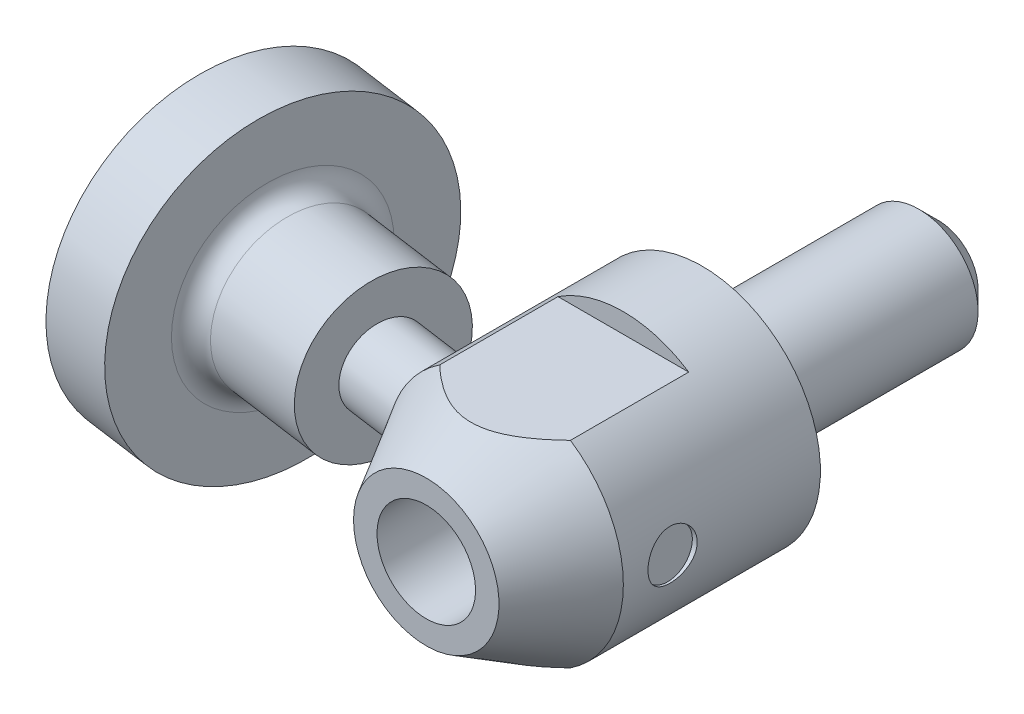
ISO-10303-21;
HEADER;
FILE_DESCRIPTION(('STEP AP214'),'2;1');
FILE_NAME('part.step','',(''),(''),'','','');
FILE_SCHEMA(('AUTOMOTIVE_DESIGN { 1 0 10303 214 1 1 1 1 }'));
ENDSEC;
DATA;
#1=APPLICATION_CONTEXT('core data for automotive mechanical design processes');
#2=APPLICATION_PROTOCOL_DEFINITION('international standard','automotive_design',2000,#1);
#3=PRODUCT_CONTEXT('',#1,'mechanical');
#4=PRODUCT('Part','Part','',(#3));
#5=PRODUCT_RELATED_PRODUCT_CATEGORY('part','',(#4));
#6=PRODUCT_DEFINITION_FORMATION('','',#4);
#7=PRODUCT_DEFINITION_CONTEXT('part definition',#1,'design');
#8=PRODUCT_DEFINITION('design','',#6,#7);
#9=PRODUCT_DEFINITION_SHAPE('','',#8);
#10=(LENGTH_UNIT() NAMED_UNIT(*) SI_UNIT(.MILLI.,.METRE.));
#11=(NAMED_UNIT(*) PLANE_ANGLE_UNIT() SI_UNIT($,.RADIAN.));
#12=(NAMED_UNIT(*) SI_UNIT($,.STERADIAN.) SOLID_ANGLE_UNIT());
#13=UNCERTAINTY_MEASURE_WITH_UNIT(LENGTH_MEASURE(1.E-05),#10,'distance_accuracy_value','');
#14=(GEOMETRIC_REPRESENTATION_CONTEXT(3) GLOBAL_UNCERTAINTY_ASSIGNED_CONTEXT((#13)) GLOBAL_UNIT_ASSIGNED_CONTEXT((#10,
#11,#12)) REPRESENTATION_CONTEXT('',''));
#15=CARTESIAN_POINT('',(0.,0.,0.));
#16=DIRECTION('',(0.,0.,1.));
#17=DIRECTION('',(1.,0.,0.));
#18=AXIS2_PLACEMENT_3D('',#15,#16,#17);
#19=CARTESIAN_POINT('',(-17.3712421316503,0.,5.40187613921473));
#20=DIRECTION('',(0.990268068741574,0.,0.139173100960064));
#21=DIRECTION('',(0.139173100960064,0.,-0.990268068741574));
#22=AXIS2_PLACEMENT_3D('',#19,#20,#21);
#23=CYLINDRICAL_SURFACE('',#22,2.);
#24=CARTESIAN_POINT('',(-9.6966645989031,0.,6.48046767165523));
#25=DIRECTION('',(-0.990268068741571,0.,-0.139173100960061));
#26=DIRECTION('',(-0.139173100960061,0.,0.990268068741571));
#27=AXIS2_PLACEMENT_3D('',#24,#25,#26);
#28=CIRCLE('',#27,2.);
#29=CARTESIAN_POINT('',(-9.97501080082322,0.,8.46100380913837));
#30=VERTEX_POINT('',#29);
#31=EDGE_CURVE('E182',#30,#30,#28,.T.);
#32=ORIENTED_EDGE('',*,*,#31,.F.);
#33=EDGE_LOOP('',(#32));
#34=FACE_BOUND('',#33,.T.);
#35=CARTESIAN_POINT('',(-6.,0.,4.98034485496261));
#36=CARTESIAN_POINT('',(-6.00000039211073,0.105603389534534,4.98034400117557));
#37=CARTESIAN_POINT('',(-5.99718509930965,0.211203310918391,4.98922090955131));
#38=CARTESIAN_POINT('',(-5.98624453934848,0.419204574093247,5.02427801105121));
#39=CARTESIAN_POINT('',(-5.97811814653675,0.52160523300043,5.05046187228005));
#40=CARTESIAN_POINT('',(-5.95746826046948,0.720077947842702,5.11882553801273));
#41=CARTESIAN_POINT('',(-5.94495719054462,0.816166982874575,5.16096017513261));
#42=CARTESIAN_POINT('',(-5.91678982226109,1.00013635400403,5.25959384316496));
#43=CARTESIAN_POINT('',(-5.9011327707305,1.08801471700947,5.3160963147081));
#44=CARTESIAN_POINT('',(-5.86725402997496,1.25827871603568,5.44502853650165));
#45=CARTESIAN_POINT('',(-5.84894035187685,1.34012567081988,5.51814419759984));
#46=CARTESIAN_POINT('',(-5.81222824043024,1.49133103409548,5.67631438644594));
#47=CARTESIAN_POINT('',(-5.79382977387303,1.56068403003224,5.76137406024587));
#48=CARTESIAN_POINT('',(-5.75735804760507,1.6904830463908,5.94856947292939));
#49=CARTESIAN_POINT('',(-5.73942503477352,1.74979423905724,6.05152305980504));
#50=CARTESIAN_POINT('',(-5.70770502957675,1.85065202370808,6.26641398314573));
#51=CARTESIAN_POINT('',(-5.69391813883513,1.89219818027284,6.37835153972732));
#52=CARTESIAN_POINT('',(-5.6724024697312,1.95575656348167,6.60761364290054));
#53=CARTESIAN_POINT('',(-5.66464247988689,1.97786950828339,6.72490705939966));
#54=CARTESIAN_POINT('',(-5.65630412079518,2.00159880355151,6.96178821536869));
#55=CARTESIAN_POINT('',(-5.65572134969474,2.00322771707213,7.0813745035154));
#56=CARTESIAN_POINT('',(-5.66177310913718,1.98604814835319,7.31025202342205));
#57=CARTESIAN_POINT('',(-5.66789403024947,1.96869417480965,7.41966746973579));
#58=CARTESIAN_POINT('',(-5.68588873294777,1.91609886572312,7.63361031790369));
#59=CARTESIAN_POINT('',(-5.69776183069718,1.88085965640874,7.73813829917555));
#60=CARTESIAN_POINT('',(-5.72538347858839,1.79497423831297,7.9358569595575));
#61=CARTESIAN_POINT('',(-5.74098917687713,1.74488256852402,8.02930985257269));
#62=CARTESIAN_POINT('',(-5.77456168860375,1.6303342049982,8.20647564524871));
#63=CARTESIAN_POINT('',(-5.79252883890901,1.56587546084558,8.29018715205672));
#64=CARTESIAN_POINT('',(-5.82949753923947,1.42218525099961,8.44829716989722));
#65=CARTESIAN_POINT('',(-5.84851396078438,1.34257140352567,8.52234460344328));
#66=CARTESIAN_POINT('',(-5.88506531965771,1.1720095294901,8.65643852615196));
#67=CARTESIAN_POINT('',(-5.90260003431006,1.08105980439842,8.71648291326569));
#68=CARTESIAN_POINT('',(-5.934823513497,0.887546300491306,8.82262516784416));
#69=CARTESIAN_POINT('',(-5.94942132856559,0.78473291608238,8.86829669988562));
#70=CARTESIAN_POINT('',(-5.97358226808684,0.572464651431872,8.94221653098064));
#71=CARTESIAN_POINT('',(-5.98314579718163,0.463010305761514,8.97046623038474));
#72=CARTESIAN_POINT('',(-5.99614808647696,0.24163085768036,9.00858547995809));
#73=CARTESIAN_POINT('',(-5.99964248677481,0.129737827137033,9.01862204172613));
#74=CARTESIAN_POINT('',(-6.00030493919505,-0.0942163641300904,9.02053636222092));
#75=CARTESIAN_POINT('',(-5.99747348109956,-0.206277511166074,9.01241552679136));
#76=CARTESIAN_POINT('',(-5.98586815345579,-0.425802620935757,8.9784859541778));
#77=CARTESIAN_POINT('',(-5.97717519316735,-0.533308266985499,8.95291799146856));
#78=CARTESIAN_POINT('',(-5.95482802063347,-0.74234815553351,8.88503046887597));
#79=CARTESIAN_POINT('',(-5.94117336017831,-0.843881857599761,8.84270939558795));
#80=CARTESIAN_POINT('',(-5.9101296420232,-1.03936495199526,8.74180457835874));
#81=CARTESIAN_POINT('',(-5.89270045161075,-1.13321660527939,8.68304391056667));
#82=CARTESIAN_POINT('',(-5.8560355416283,-1.30956921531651,8.55085652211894));
#83=CARTESIAN_POINT('',(-5.83679957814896,-1.3920686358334,8.47742781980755));
#84=CARTESIAN_POINT('',(-5.79835952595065,-1.54443845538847,8.31658948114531));
#85=CARTESIAN_POINT('',(-5.77915893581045,-1.61413540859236,8.22901433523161));
#86=CARTESIAN_POINT('',(-5.74327200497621,-1.73751869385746,8.04277132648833));
#87=CARTESIAN_POINT('',(-5.72658508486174,-1.79120871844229,7.94410602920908));
#88=CARTESIAN_POINT('',(-5.69809288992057,-1.87985839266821,7.74084260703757));
#89=CARTESIAN_POINT('',(-5.68618184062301,-1.91522962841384,7.63643909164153));
#90=CARTESIAN_POINT('',(-5.66809902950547,-1.96810732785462,7.42274234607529));
#91=CARTESIAN_POINT('',(-5.6619258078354,-1.98561833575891,7.31345036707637));
#92=CARTESIAN_POINT('',(-5.65606780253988,-2.0022408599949,7.09689407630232));
#93=CARTESIAN_POINT('',(-5.65617961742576,-2.00192916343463,6.98967851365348));
#94=CARTESIAN_POINT('',(-5.66222889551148,-1.98475225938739,6.77676166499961));
#95=CARTESIAN_POINT('',(-5.66816726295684,-1.96788448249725,6.67106061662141));
#96=CARTESIAN_POINT('',(-5.68529598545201,-1.91784226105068,6.46119378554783));
#97=CARTESIAN_POINT('',(-5.69661631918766,-1.8842632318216,6.35713576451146));
#98=CARTESIAN_POINT('',(-5.72322741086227,-1.80181451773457,6.15580547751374));
#99=CARTESIAN_POINT('',(-5.73851963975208,-1.75293916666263,6.05853574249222));
#100=CARTESIAN_POINT('',(-5.77267388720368,-1.63711101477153,5.86618145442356));
#101=CARTESIAN_POINT('',(-5.79171362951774,-1.56911021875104,5.77175817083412));
#102=CARTESIAN_POINT('',(-5.83042885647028,-1.41849819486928,5.59547141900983));
#103=CARTESIAN_POINT('',(-5.85010457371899,-1.3358815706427,5.5136126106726));
#104=CARTESIAN_POINT('',(-5.88846059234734,-1.15532161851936,5.36285076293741));
#105=CARTESIAN_POINT('',(-5.90709923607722,-1.05702239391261,5.29436089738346));
#106=CARTESIAN_POINT('',(-5.94052421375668,-0.849235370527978,5.17593682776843));
#107=CARTESIAN_POINT('',(-5.95531359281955,-0.739756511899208,5.12598794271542));
#108=CARTESIAN_POINT('',(-5.97773608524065,-0.526142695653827,5.05170217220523));
#109=CARTESIAN_POINT('',(-5.9860032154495,-0.422876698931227,5.0250555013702));
#110=CARTESIAN_POINT('',(-5.99713367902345,-0.213071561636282,4.98938149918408));
#111=CARTESIAN_POINT('',(-5.99999960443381,-0.106534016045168,4.98034571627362));
#112=CARTESIAN_POINT('',(-6.,0.,4.98034485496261));
#113=B_SPLINE_CURVE_WITH_KNOTS('',3,(#35,#36,#37,#38,#39,#40,#41,#42,#43,#44,#45,#46,#47,#48,
#49,#50,#51,#52,#53,#54,#55,#56,#57,#58,#59,#60,#61,#62,#63,#64,#65,#66,#67,#68,#69,#70,#71,#72,
#73,#74,#75,#76,#77,#78,#79,#80,#81,#82,#83,#84,#85,#86,#87,#88,#89,#90,#91,#92,#93,#94,#95,#96,
#97,#98,#99,#100,#101,#102,#103,#104,#105,#106,#107,#108,#109,#110,#111,#112),.UNSPECIFIED.,.T.,
.F.,(4,2,2,2,2,2,2,2,2,2,2,2,2,2,2,2,2,2,2,2,2,2,2,2,2,2,2,2,2,2,2,2,2,2,2,2,2,2,4),(0.,
0.31640530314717,0.632877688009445,0.948460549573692,1.26411905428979,1.5965227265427,
1.92907005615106,2.28786090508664,2.64666054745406,3.0035894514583,3.36029943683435,
3.69147707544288,4.02261535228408,4.34268179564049,4.66279394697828,4.9924277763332,
5.32211105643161,5.66081085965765,5.99948343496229,6.33503443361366,6.67055945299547,
7.00154537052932,7.33256119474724,7.66728635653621,8.00205677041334,8.34107310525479,
8.68001117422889,9.01096176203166,9.34182812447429,9.66199308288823,9.98220773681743,
10.3105823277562,10.6390787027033,10.9912205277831,11.3434926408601,11.7053508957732,
12.0669220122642,12.3862689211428,12.7054625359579),.UNSPECIFIED.);
#114=CARTESIAN_POINT('',(-6.,0.,4.98034485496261));
#115=VERTEX_POINT('',#114);
#116=EDGE_CURVE('E10',#115,#115,#113,.T.);
#117=ORIENTED_EDGE('',*,*,#116,.F.);
#118=EDGE_LOOP('',(#117));
#119=FACE_BOUND('',#118,.T.);
#120=ADVANCED_FACE('F16',(#34,#119),#23,.T.);
#121=CARTESIAN_POINT('',(-10.0368338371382,0.,8.90089756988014));
#122=DIRECTION('',(-0.990268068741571,0.,-0.139173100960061));
#123=DIRECTION('',(-0.139173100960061,0.,0.990268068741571));
#124=AXIS2_PLACEMENT_3D('',#121,#122,#123);
#125=PLANE('',#124);
#126=ORIENTED_EDGE('',*,*,#31,.T.);
#127=EDGE_LOOP('',(#126));
#128=FACE_BOUND('',#127,.T.);
#129=CARTESIAN_POINT('',(-9.69666459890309,0.,6.48046767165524));
#130=DIRECTION('',(0.990268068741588,0.,0.139173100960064));
#131=DIRECTION('',(0.,-1.,0.));
#132=AXIS2_PLACEMENT_3D('',#129,#130,#131);
#133=CIRCLE('',#132,4.);
#134=CARTESIAN_POINT('',(-9.69666459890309,-4.,6.48046767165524));
#135=VERTEX_POINT('',#134);
#136=EDGE_CURVE('E293',#135,#135,#133,.T.);
#137=ORIENTED_EDGE('',*,*,#136,.T.);
#138=EDGE_LOOP('',(#137));
#139=FACE_BOUND('',#138,.T.);
#140=ADVANCED_FACE('F171',(#128,#139),#125,.F.);
#141=CARTESIAN_POINT('',(-4.09486246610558,0.,7.26774961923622));
#142=DIRECTION('',(-0.990268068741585,0.,-0.139173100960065));
#143=DIRECTION('',(0.,1.,0.));
#144=AXIS2_PLACEMENT_3D('',#141,#142,#143);
#145=CYLINDRICAL_SURFACE('',#144,1.65);
#146=CARTESIAN_POINT('',(-19.104211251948,0.,5.15832321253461));
#147=DIRECTION('',(-0.990268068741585,0.,-0.139173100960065));
#148=DIRECTION('',(0.,1.,0.));
#149=AXIS2_PLACEMENT_3D('',#146,#147,#148);
#150=CIRCLE('',#149,1.65);
#151=CARTESIAN_POINT('',(-19.104211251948,1.64999999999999,5.15832321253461));
#152=VERTEX_POINT('',#151);
#153=EDGE_CURVE('E99',#152,#152,#150,.T.);
#154=ORIENTED_EDGE('',*,*,#153,.T.);
#155=EDGE_LOOP('',(#154));
#156=FACE_BOUND('',#155,.T.);
#157=CARTESIAN_POINT('',(-17.6188091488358,0.,5.36708286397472));
#158=DIRECTION('',(0.990268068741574,0.,0.139173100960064));
#159=DIRECTION('',(0.139173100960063,0.,-0.990268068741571));
#160=AXIS2_PLACEMENT_3D('',#157,#158,#159);
#161=CIRCLE('',#160,1.65);
#162=CARTESIAN_POINT('',(-17.3891735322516,0.,3.73314055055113));
#163=VERTEX_POINT('',#162);
#164=EDGE_CURVE('E29',#163,#163,#161,.T.);
#165=ORIENTED_EDGE('',*,*,#164,.T.);
#166=EDGE_LOOP('',(#165));
#167=FACE_BOUND('',#166,.T.);
#168=ADVANCED_FACE('F176',(#156,#167),#145,.F.);
#169=CARTESIAN_POINT('',(-19.104211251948,2.,5.15832321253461));
#170=DIRECTION('',(0.990268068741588,0.,0.139173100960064));
#171=DIRECTION('',(0.,-1.,0.));
#172=AXIS2_PLACEMENT_3D('',#169,#170,#171);
#173=PLANE('',#172);
#174=CARTESIAN_POINT('',(-19.1042112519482,0.,5.15832321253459));
#175=DIRECTION('',(0.990268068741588,0.,0.139173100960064));
#176=DIRECTION('',(0.,-1.,0.));
#177=AXIS2_PLACEMENT_3D('',#174,#175,#176);
#178=CIRCLE('',#177,8.);
#179=CARTESIAN_POINT('',(-19.1042112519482,-8.00000000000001,5.15832321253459));
#180=VERTEX_POINT('',#179);
#181=EDGE_CURVE('E278',#180,#180,#178,.T.);
#182=ORIENTED_EDGE('',*,*,#181,.F.);
#183=EDGE_LOOP('',(#182));
#184=FACE_BOUND('',#183,.T.);
#185=ORIENTED_EDGE('',*,*,#153,.F.);
#186=EDGE_LOOP('',(#185));
#187=FACE_BOUND('',#186,.T.);
#188=ADVANCED_FACE('F247',(#184,#187),#173,.F.);
#189=CARTESIAN_POINT('',(10.9744974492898,0.,9.38561004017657));
#190=DIRECTION('',(0.990268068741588,0.,0.139173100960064));
#191=DIRECTION('',(0.,-1.,0.));
#192=AXIS2_PLACEMENT_3D('',#189,#190,#191);
#193=CYLINDRICAL_SURFACE('',#192,8.);
#194=CARTESIAN_POINT('',(-15.6382730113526,0.,5.64542906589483));
#195=DIRECTION('',(0.990268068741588,0.,0.139173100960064));
#196=DIRECTION('',(0.,-1.,0.));
#197=AXIS2_PLACEMENT_3D('',#194,#195,#196);
#198=CIRCLE('',#197,8.);
#199=CARTESIAN_POINT('',(-15.6382730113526,-8.00000000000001,5.64542906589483));
#200=VERTEX_POINT('',#199);
#201=EDGE_CURVE('E283',#200,#200,#198,.T.);
#202=ORIENTED_EDGE('',*,*,#201,.F.);
#203=EDGE_LOOP('',(#202));
#204=FACE_BOUND('',#203,.T.);
#205=ORIENTED_EDGE('',*,*,#181,.T.);
#206=EDGE_LOOP('',(#205));
#207=FACE_BOUND('',#206,.T.);
#208=ADVANCED_FACE('F260',(#204,#207),#193,.T.);
#209=CARTESIAN_POINT('',(-15.6382730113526,4.99999999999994,5.64542906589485));
#210=DIRECTION('',(-0.990268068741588,0.,-0.139173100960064));
#211=DIRECTION('',(0.,1.,0.));
#212=AXIS2_PLACEMENT_3D('',#209,#210,#211);
#213=PLANE('',#212);
#214=CARTESIAN_POINT('',(-15.6382730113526,0.,5.64542906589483));
#215=DIRECTION('',(0.990268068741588,0.,0.139173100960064));
#216=DIRECTION('',(0.,-1.,0.));
#217=AXIS2_PLACEMENT_3D('',#214,#215,#216);
#218=CIRCLE('',#217,5.);
#219=CARTESIAN_POINT('',(-15.6382730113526,-5.00000000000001,5.64542906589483));
#220=VERTEX_POINT('',#219);
#221=EDGE_CURVE('E287',#220,#220,#218,.T.);
#222=ORIENTED_EDGE('',*,*,#221,.F.);
#223=EDGE_LOOP('',(#222));
#224=FACE_BOUND('',#223,.T.);
#225=ORIENTED_EDGE('',*,*,#201,.T.);
#226=EDGE_LOOP('',(#225));
#227=FACE_BOUND('',#226,.T.);
#228=ADVANCED_FACE('F256',(#224,#227),#213,.F.);
#229=CARTESIAN_POINT('',(-14.648004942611,0.,5.78460216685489));
#230=DIRECTION('',(0.990268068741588,0.,0.139173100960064));
#231=DIRECTION('',(0.,-1.,0.));
#232=AXIS2_PLACEMENT_3D('',#229,#230,#231);
#233=TOROIDAL_SURFACE('',#232,5.,1.);
#234=CARTESIAN_POINT('',(-14.648004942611,0.,5.78460216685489));
#235=DIRECTION('',(0.990268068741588,0.,0.139173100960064));
#236=DIRECTION('',(0.,-1.,0.));
#237=AXIS2_PLACEMENT_3D('',#234,#235,#236);
#238=CIRCLE('',#237,4.);
#239=CARTESIAN_POINT('',(-14.648004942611,-4.,5.78460216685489));
#240=VERTEX_POINT('',#239);
#241=EDGE_CURVE('E291',#240,#240,#238,.T.);
#242=ORIENTED_EDGE('',*,*,#241,.F.);
#243=EDGE_LOOP('',(#242));
#244=FACE_BOUND('',#243,.T.);
#245=ORIENTED_EDGE('',*,*,#221,.T.);
#246=EDGE_LOOP('',(#245));
#247=FACE_BOUND('',#246,.T.);
#248=ADVANCED_FACE('F252',(#244,#247),#233,.F.);
#249=CARTESIAN_POINT('',(10.9744974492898,0.,9.38561004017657));
#250=DIRECTION('',(0.990268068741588,0.,0.139173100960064));
#251=DIRECTION('',(0.,-1.,0.));
#252=AXIS2_PLACEMENT_3D('',#249,#250,#251);
#253=CYLINDRICAL_SURFACE('',#252,4.);
#254=ORIENTED_EDGE('',*,*,#136,.F.);
#255=EDGE_LOOP('',(#254));
#256=FACE_BOUND('',#255,.T.);
#257=ORIENTED_EDGE('',*,*,#241,.T.);
#258=EDGE_LOOP('',(#257));
#259=FACE_BOUND('',#258,.T.);
#260=ADVANCED_FACE('F249',(#256,#259),#253,.T.);
#261=CARTESIAN_POINT('',(-17.6188091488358,0.,5.36708286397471));
#262=DIRECTION('',(0.990268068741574,0.,0.139173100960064));
#263=DIRECTION('',(0.139173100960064,0.,-0.990268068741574));
#264=AXIS2_PLACEMENT_3D('',#261,#262,#263);
#265=PLANE('',#264);
#266=ORIENTED_EDGE('',*,*,#164,.F.);
#267=EDGE_LOOP('',(#266));
#268=FACE_BOUND('',#267,.T.);
#269=ADVANCED_FACE('F191',(#268),#265,.F.);
#270=CARTESIAN_POINT('',(0.,0.,-38.3689686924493));
#271=DIRECTION('',(0.,0.,-1.));
#272=DIRECTION('',(-1.,0.,0.));
#273=AXIS2_PLACEMENT_3D('',#270,#271,#272);
#274=CYLINDRICAL_SURFACE('',#273,2.5);
#275=CARTESIAN_POINT('',(0.,0.,1.5));
#276=DIRECTION('',(0.,0.,-1.));
#277=DIRECTION('',(-1.,0.,0.));
#278=AXIS2_PLACEMENT_3D('',#275,#276,#277);
#279=CIRCLE('',#278,2.5);
#280=CARTESIAN_POINT('',(-2.5,0.,1.5));
#281=VERTEX_POINT('',#280);
#282=EDGE_CURVE('E214',#281,#281,#279,.T.);
#283=ORIENTED_EDGE('',*,*,#282,.T.);
#284=EDGE_LOOP('',(#283));
#285=FACE_BOUND('',#284,.T.);
#286=CARTESIAN_POINT('',(0.,0.,14.));
#287=DIRECTION('',(0.,0.,-1.));
#288=DIRECTION('',(-1.,0.,0.));
#289=AXIS2_PLACEMENT_3D('',#286,#287,#288);
#290=CIRCLE('',#289,2.5);
#291=CARTESIAN_POINT('',(-2.5,0.,14.));
#292=VERTEX_POINT('',#291);
#293=EDGE_CURVE('E210',#292,#292,#290,.T.);
#294=ORIENTED_EDGE('',*,*,#293,.F.);
#295=EDGE_LOOP('',(#294));
#296=FACE_BOUND('',#295,.T.);
#297=ADVANCED_FACE('F186',(#285,#296),#274,.F.);
#298=CARTESIAN_POINT('',(0.,0.,-38.3689686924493));
#299=DIRECTION('',(0.,0.,-1.));
#300=DIRECTION('',(-1.,0.,0.));
#301=AXIS2_PLACEMENT_3D('',#298,#299,#300);
#302=CYLINDRICAL_SURFACE('',#301,6.);
#303=CARTESIAN_POINT('',(0.,0.,0.));
#304=DIRECTION('',(0.,0.,-1.));
#305=DIRECTION('',(-1.,0.,0.));
#306=AXIS2_PLACEMENT_3D('',#303,#304,#305);
#307=CIRCLE('',#306,6.);
#308=CARTESIAN_POINT('',(-6.,0.,0.));
#309=VERTEX_POINT('',#308);
#310=EDGE_CURVE('E195',#309,#309,#307,.T.);
#311=ORIENTED_EDGE('',*,*,#310,.F.);
#312=EDGE_LOOP('',(#311));
#313=FACE_BOUND('',#312,.T.);
#314=CARTESIAN_POINT('',(0.,0.,10.));
#315=DIRECTION('',(0.,0.,-1.));
#316=DIRECTION('',(-1.,0.,0.));
#317=AXIS2_PLACEMENT_3D('',#314,#315,#316);
#318=CIRCLE('',#317,6.);
#319=CARTESIAN_POINT('',(3.31662479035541,5.,10.));
#320=VERTEX_POINT('',#319);
#321=CARTESIAN_POINT('',(3.31662479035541,-5.,10.));
#322=VERTEX_POINT('',#321);
#323=EDGE_CURVE('E82',#320,#322,#318,.T.);
#324=ORIENTED_EDGE('',*,*,#323,.T.);
#325=DIRECTION('',(0.,0.,-1.));
#326=VECTOR('',#325,1.);
#327=CARTESIAN_POINT('',(3.31662479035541,-5.,-38.3689686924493));
#328=LINE('',#327,#326);
#329=CARTESIAN_POINT('',(3.31662479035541,-5.,4.));
#330=VERTEX_POINT('',#329);
#331=EDGE_CURVE('E71',#322,#330,#328,.T.);
#332=ORIENTED_EDGE('',*,*,#331,.T.);
#333=CARTESIAN_POINT('',(0.,0.,4.));
#334=DIRECTION('',(0.,0.,1.));
#335=DIRECTION('',(1.,0.,0.));
#336=AXIS2_PLACEMENT_3D('',#333,#334,#335);
#337=CIRCLE('',#336,6.);
#338=CARTESIAN_POINT('',(-3.31662479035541,-5.,4.));
#339=VERTEX_POINT('',#338);
#340=EDGE_CURVE('E60',#339,#330,#337,.T.);
#341=ORIENTED_EDGE('',*,*,#340,.F.);
#342=DIRECTION('',(0.,0.,-1.));
#343=VECTOR('',#342,1.);
#344=CARTESIAN_POINT('',(-3.31662479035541,-5.,-38.3689686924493));
#345=LINE('',#344,#343);
#346=CARTESIAN_POINT('',(-3.31662479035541,-5.,10.));
#347=VERTEX_POINT('',#346);
#348=EDGE_CURVE('E66',#339,#347,#345,.F.);
#349=ORIENTED_EDGE('',*,*,#348,.T.);
#350=CARTESIAN_POINT('',(-3.31662479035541,5.,10.));
#351=VERTEX_POINT('',#350);
#352=EDGE_CURVE('E197',#347,#351,#318,.T.);
#353=ORIENTED_EDGE('',*,*,#352,.T.);
#354=DIRECTION('',(0.,0.,-1.));
#355=VECTOR('',#354,1.);
#356=CARTESIAN_POINT('',(-3.31662479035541,5.,-38.3689686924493));
#357=LINE('',#356,#355);
#358=CARTESIAN_POINT('',(-3.31662479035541,5.,4.));
#359=VERTEX_POINT('',#358);
#360=EDGE_CURVE('E67',#351,#359,#357,.T.);
#361=ORIENTED_EDGE('',*,*,#360,.T.);
#362=CARTESIAN_POINT('',(0.,0.,4.));
#363=DIRECTION('',(0.,0.,1.));
#364=DIRECTION('',(1.,0.,0.));
#365=AXIS2_PLACEMENT_3D('',#362,#363,#364);
#366=CIRCLE('',#365,6.);
#367=CARTESIAN_POINT('',(3.31662479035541,5.,4.));
#368=VERTEX_POINT('',#367);
#369=EDGE_CURVE('E218',#368,#359,#366,.T.);
#370=ORIENTED_EDGE('',*,*,#369,.F.);
#371=DIRECTION('',(0.,0.,-1.));
#372=VECTOR('',#371,1.);
#373=CARTESIAN_POINT('',(3.31662479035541,5.,-38.3689686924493));
#374=LINE('',#373,#372);
#375=EDGE_CURVE('E221',#368,#320,#374,.F.);
#376=ORIENTED_EDGE('',*,*,#375,.T.);
#377=EDGE_LOOP('',(#324,#332,#341,#349,#353,#361,#370,#376));
#378=FACE_BOUND('',#377,.T.);
#379=CARTESIAN_POINT('',(6.,0.,8.75));
#380=CARTESIAN_POINT('',(5.99999871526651,0.0694090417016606,8.74999752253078));
#381=CARTESIAN_POINT('',(5.99878328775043,0.138848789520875,8.74419933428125));
#382=CARTESIAN_POINT('',(5.9940520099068,0.275761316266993,8.72118065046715));
#383=CARTESIAN_POINT('',(5.99053441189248,0.343232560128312,8.70395147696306));
#384=CARTESIAN_POINT('',(5.98159109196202,0.474209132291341,8.65862954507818));
#385=CARTESIAN_POINT('',(5.97616727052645,0.537718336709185,8.63054760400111));
#386=CARTESIAN_POINT('',(5.96399927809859,0.659120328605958,8.56435039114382));
#387=CARTESIAN_POINT('',(5.95725516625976,0.717013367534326,8.52623556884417));
#388=CARTESIAN_POINT('',(5.94307700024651,0.826390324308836,8.44046365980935));
#389=CARTESIAN_POINT('',(5.93563505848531,0.877780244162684,8.39268799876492));
#390=CARTESIAN_POINT('',(5.92095657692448,0.971877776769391,8.28920534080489));
#391=CARTESIAN_POINT('',(5.91372005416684,1.01458467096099,8.23349768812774));
#392=CARTESIAN_POINT('',(5.90019442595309,1.09051031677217,8.11504803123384));
#393=CARTESIAN_POINT('',(5.89391545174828,1.12363054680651,8.05224161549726));
#394=CARTESIAN_POINT('',(5.8831284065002,1.17881119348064,7.92180254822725));
#395=CARTESIAN_POINT('',(5.87862014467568,1.20087280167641,7.85417041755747));
#396=CARTESIAN_POINT('',(5.87196500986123,1.23300240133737,7.71701476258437));
#397=CARTESIAN_POINT('',(5.86978556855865,1.24323597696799,7.64753164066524));
#398=CARTESIAN_POINT('',(5.86793690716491,1.25193357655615,7.50780315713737));
#399=CARTESIAN_POINT('',(5.86826740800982,1.25039890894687,7.43755788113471));
#400=CARTESIAN_POINT('',(5.87137174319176,1.23573719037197,7.29951897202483));
#401=CARTESIAN_POINT('',(5.87410533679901,1.2228010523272,7.23170402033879));
#402=CARTESIAN_POINT('',(5.88164437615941,1.18600543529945,7.09922849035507));
#403=CARTESIAN_POINT('',(5.88644992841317,1.16214539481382,7.03456807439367));
#404=CARTESIAN_POINT('',(5.89763191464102,1.10400003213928,6.90969277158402));
#405=CARTESIAN_POINT('',(5.90401953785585,1.06964002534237,6.84951370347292));
#406=CARTESIAN_POINT('',(5.91763890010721,0.991522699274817,6.73570425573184));
#407=CARTESIAN_POINT('',(5.92487074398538,0.947764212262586,6.68207469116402));
#408=CARTESIAN_POINT('',(5.9395373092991,0.851074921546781,6.58178603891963));
#409=CARTESIAN_POINT('',(5.94697323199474,0.797981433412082,6.53528383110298));
#410=CARTESIAN_POINT('',(5.96108088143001,0.684667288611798,6.45181955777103));
#411=CARTESIAN_POINT('',(5.96775259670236,0.624446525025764,6.41485763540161));
#412=CARTESIAN_POINT('',(5.97959870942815,0.498405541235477,6.35148991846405));
#413=CARTESIAN_POINT('',(5.98477039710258,0.432575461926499,6.32510319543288));
#414=CARTESIAN_POINT('',(5.99301338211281,0.297284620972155,6.2838082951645));
#415=CARTESIAN_POINT('',(5.99608495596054,0.227824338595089,6.2688986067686));
#416=CARTESIAN_POINT('',(5.99974275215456,0.0885918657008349,6.25120574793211));
#417=CARTESIAN_POINT('',(6.00037293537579,0.0188480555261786,6.24820805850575));
#418=CARTESIAN_POINT('',(5.99919952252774,-0.120143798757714,6.2538449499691));
#419=CARTESIAN_POINT('',(5.99739607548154,-0.189391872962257,6.2624788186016));
#420=CARTESIAN_POINT('',(5.99158564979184,-0.324726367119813,6.29095565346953));
#421=CARTESIAN_POINT('',(5.98760052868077,-0.390837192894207,6.31068748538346));
#422=CARTESIAN_POINT('',(5.97787227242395,-0.518811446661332,6.36067786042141));
#423=CARTESIAN_POINT('',(5.97212899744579,-0.580674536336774,6.39093724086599));
#424=CARTESIAN_POINT('',(5.95941241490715,-0.699294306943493,6.46158037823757));
#425=CARTESIAN_POINT('',(5.9524239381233,-0.755973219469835,6.50209192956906));
#426=CARTESIAN_POINT('',(5.93802568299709,-0.861805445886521,6.59191956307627));
#427=CARTESIAN_POINT('',(5.93061585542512,-0.910957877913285,6.64123667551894));
#428=CARTESIAN_POINT('',(5.91606024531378,-1.0011786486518,6.7482555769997));
#429=CARTESIAN_POINT('',(5.90892089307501,-1.04209914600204,6.80608303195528));
#430=CARTESIAN_POINT('',(5.89585601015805,-1.11364719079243,6.92791628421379));
#431=CARTESIAN_POINT('',(5.88993042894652,-1.14427516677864,6.99192182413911));
#432=CARTESIAN_POINT('',(5.88001700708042,-1.19417246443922,7.12396119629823));
#433=CARTESIAN_POINT('',(5.87601872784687,-1.21350309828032,7.19197103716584));
#434=CARTESIAN_POINT('',(5.87039184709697,-1.24044038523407,7.33036655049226));
#435=CARTESIAN_POINT('',(5.86876290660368,-1.24804871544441,7.40075188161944));
#436=CARTESIAN_POINT('',(5.86807907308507,-1.25125926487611,7.54041340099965));
#437=CARTESIAN_POINT('',(5.86897402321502,-1.24709542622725,7.60968407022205));
#438=CARTESIAN_POINT('',(5.87312447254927,-1.22739905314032,7.74651400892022));
#439=CARTESIAN_POINT('',(5.87637994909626,-1.21186662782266,7.8140732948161));
#440=CARTESIAN_POINT('',(5.88486132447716,-1.16998217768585,7.94539777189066));
#441=CARTESIAN_POINT('',(5.8900815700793,-1.14366117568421,8.00917324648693));
#442=CARTESIAN_POINT('',(5.90190705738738,-1.08097457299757,8.13143877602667));
#443=CARTESIAN_POINT('',(5.90851242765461,-1.0446080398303,8.18992833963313));
#444=CARTESIAN_POINT('',(5.92251579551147,-0.962073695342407,8.30112162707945));
#445=CARTESIAN_POINT('',(5.92992613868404,-0.915737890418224,8.35369912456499));
#446=CARTESIAN_POINT('',(5.94461839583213,-0.814924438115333,8.45040949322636));
#447=CARTESIAN_POINT('',(5.9519002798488,-0.760444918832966,8.49454041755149));
#448=CARTESIAN_POINT('',(5.96561444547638,-0.644134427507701,8.57358857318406));
#449=CARTESIAN_POINT('',(5.97203596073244,-0.582225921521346,8.60839367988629));
#450=CARTESIAN_POINT('',(5.98319908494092,-0.453319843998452,8.66705022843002));
#451=CARTESIAN_POINT('',(5.98794216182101,-0.386326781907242,8.69091124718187));
#452=CARTESIAN_POINT('',(5.99432499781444,-0.266015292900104,8.72254027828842));
#453=CARTESIAN_POINT('',(5.99644035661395,-0.213367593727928,8.73281876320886));
#454=CARTESIAN_POINT('',(5.99927832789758,-0.107152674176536,8.74654945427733));
#455=CARTESIAN_POINT('',(6.00000099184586,-0.0535854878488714,8.75000191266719));
#456=CARTESIAN_POINT('',(6.,0.,8.75));
#457=B_SPLINE_CURVE_WITH_KNOTS('',3,(#379,#380,#381,#382,#383,#384,#385,#386,#387,#388,#389,
#390,#391,#392,#393,#394,#395,#396,#397,#398,#399,#400,#401,#402,#403,#404,#405,#406,#407,#408,
#409,#410,#411,#412,#413,#414,#415,#416,#417,#418,#419,#420,#421,#422,#423,#424,#425,#426,#427,
#428,#429,#430,#431,#432,#433,#434,#435,#436,#437,#438,#439,#440,#441,#442,#443,#444,#445,#446,
#447,#448,#449,#450,#451,#452,#453,#454,#455,#456),.UNSPECIFIED.,.T.,.F.,(4,2,2,2,2,2,2,2,2,2,2,
2,2,2,2,2,2,2,2,2,2,2,2,2,2,2,2,2,2,2,2,2,2,2,2,2,2,2,4),(0.,0.208031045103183,
0.416220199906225,0.624202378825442,0.832175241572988,1.04287526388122,1.25359271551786,
1.46640449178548,1.6791933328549,1.88896575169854,2.09871484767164,2.30501712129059,
2.5113300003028,2.71914592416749,2.92698768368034,3.13889526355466,3.35080602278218,
3.56309724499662,3.77536051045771,3.98378339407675,4.19219351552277,4.39855286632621,
4.60492863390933,4.81401583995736,5.02312752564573,5.23571263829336,5.44828889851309,
5.65970050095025,5.87108185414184,6.07829223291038,6.28550062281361,6.49211731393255,
6.6987531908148,6.90919024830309,7.11967575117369,7.33258864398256,7.54531486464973,
7.7059258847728,7.86653096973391),.UNSPECIFIED.);
#458=CARTESIAN_POINT('',(6.,0.,8.75));
#459=VERTEX_POINT('',#458);
#460=EDGE_CURVE('E84',#459,#459,#457,.T.);
#461=ORIENTED_EDGE('',*,*,#460,.T.);
#462=EDGE_LOOP('',(#461));
#463=FACE_BOUND('',#462,.T.);
#464=ORIENTED_EDGE('',*,*,#116,.T.);
#465=EDGE_LOOP('',(#464));
#466=FACE_BOUND('',#465,.T.);
#467=ADVANCED_FACE('F78',(#313,#378,#463,#466),#302,.T.);
#468=CARTESIAN_POINT('',(-12.6621649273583,0.,7.5));
#469=DIRECTION('',(-1.,0.,0.));
#470=DIRECTION('',(0.,0.,1.));
#471=AXIS2_PLACEMENT_3D('',#468,#469,#470);
#472=CYLINDRICAL_SURFACE('',#471,1.25);
#473=ORIENTED_EDGE('',*,*,#460,.F.);
#474=EDGE_LOOP('',(#473));
#475=FACE_BOUND('',#474,.T.);
#476=CARTESIAN_POINT('',(5.75,0.,7.5));
#477=DIRECTION('',(-1.,0.,0.));
#478=DIRECTION('',(0.,0.,1.));
#479=AXIS2_PLACEMENT_3D('',#476,#477,#478);
#480=CIRCLE('',#479,1.25);
#481=CARTESIAN_POINT('',(5.75,0.,8.75));
#482=VERTEX_POINT('',#481);
#483=EDGE_CURVE('E90',#482,#482,#480,.F.);
#484=ORIENTED_EDGE('',*,*,#483,.F.);
#485=EDGE_LOOP('',(#484));
#486=FACE_BOUND('',#485,.T.);
#487=ADVANCED_FACE('F104',(#475,#486),#472,.F.);
#488=CARTESIAN_POINT('',(0.9,0.,1.5));
#489=DIRECTION('',(0.,0.,-1.));
#490=DIRECTION('',(-1.,0.,0.));
#491=AXIS2_PLACEMENT_3D('',#488,#489,#490);
#492=PLANE('',#491);
#493=ORIENTED_EDGE('',*,*,#282,.F.);
#494=EDGE_LOOP('',(#493));
#495=FACE_BOUND('',#494,.T.);
#496=ADVANCED_FACE('F109',(#495),#492,.F.);
#497=CARTESIAN_POINT('',(2.5,0.,14.));
#498=DIRECTION('',(0.,0.,-1.));
#499=DIRECTION('',(-1.,0.,0.));
#500=AXIS2_PLACEMENT_3D('',#497,#498,#499);
#501=PLANE('',#500);
#502=CARTESIAN_POINT('',(0.,0.,14.));
#503=DIRECTION('',(0.,0.,-1.));
#504=DIRECTION('',(-1.,0.,0.));
#505=AXIS2_PLACEMENT_3D('',#502,#503,#504);
#506=CIRCLE('',#505,3.6905989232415);
#507=CARTESIAN_POINT('',(-3.6905989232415,0.,14.));
#508=VERTEX_POINT('',#507);
#509=EDGE_CURVE('E206',#508,#508,#506,.T.);
#510=ORIENTED_EDGE('',*,*,#509,.F.);
#511=EDGE_LOOP('',(#510));
#512=FACE_BOUND('',#511,.T.);
#513=ORIENTED_EDGE('',*,*,#293,.T.);
#514=EDGE_LOOP('',(#513));
#515=FACE_BOUND('',#514,.T.);
#516=ADVANCED_FACE('F134',(#512,#515),#501,.F.);
#517=CARTESIAN_POINT('',(0.,0.,14.));
#518=DIRECTION('',(0.,0.,-1.));
#519=DIRECTION('',(-1.,0.,0.));
#520=AXIS2_PLACEMENT_3D('',#517,#518,#519);
#521=CONICAL_SURFACE('',#520,3.6905989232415,0.523598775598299);
#522=ORIENTED_EDGE('',*,*,#352,.F.);
#523=CARTESIAN_POINT('',(-8.29945801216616,-5.,3.61008181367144));
#524=CARTESIAN_POINT('',(-8.1200267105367,-5.,3.87624090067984));
#525=CARTESIAN_POINT('',(-7.93956994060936,-5.,4.14171540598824));
#526=CARTESIAN_POINT('',(-7.57607018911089,-5.,4.6709493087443));
#527=CARTESIAN_POINT('',(-7.39302679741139,-5.,4.93470842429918));
#528=CARTESIAN_POINT('',(-7.02259086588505,-5.,5.4619086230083));
#529=CARTESIAN_POINT('',(-6.8351769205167,-5.,5.72533471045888));
#530=CARTESIAN_POINT('',(-6.55119561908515,-5.,6.11838451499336));
#531=CARTESIAN_POINT('',(-6.45606370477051,-5.,6.24904584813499));
#532=CARTESIAN_POINT('',(-6.26472341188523,-5.,6.50958884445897));
#533=CARTESIAN_POINT('',(-6.16851497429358,-5.,6.63947046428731));
#534=CARTESIAN_POINT('',(-5.85982609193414,-5.,7.05221179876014));
#535=CARTESIAN_POINT('',(-5.64508130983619,-5.,7.33338600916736));
#536=CARTESIAN_POINT('',(-5.20818522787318,-5.,7.88992122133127));
#537=CARTESIAN_POINT('',(-4.98603468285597,-5.,8.16528281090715));
#538=CARTESIAN_POINT('',(-4.64567957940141,-5.,8.57168693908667));
#539=CARTESIAN_POINT('',(-4.53121131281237,-5.,8.70585825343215));
#540=CARTESIAN_POINT('',(-4.29937052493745,-5.,8.97166320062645));
#541=CARTESIAN_POINT('',(-4.18199816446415,-5.,9.10329697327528));
#542=CARTESIAN_POINT('',(-3.94389580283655,-5.,9.36337243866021));
#543=CARTESIAN_POINT('',(-3.82316760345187,-5.,9.49181577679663));
#544=CARTESIAN_POINT('',(-3.57767252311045,-5.,9.74477071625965));
#545=CARTESIAN_POINT('',(-3.4529062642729,-5.,9.86928291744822));
#546=CARTESIAN_POINT('',(-3.25839524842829,-5.,10.0558635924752));
#547=CARTESIAN_POINT('',(-3.19038755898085,-5.,10.1197440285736));
#548=CARTESIAN_POINT('',(-3.05287846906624,-5.,10.2458766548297));
#549=CARTESIAN_POINT('',(-2.98337704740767,-5.,10.3081288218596));
#550=CARTESIAN_POINT('',(-2.77232866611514,-5.,10.4921567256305));
#551=CARTESIAN_POINT('',(-2.62830748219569,-5.,10.6111360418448));
#552=CARTESIAN_POINT('',(-2.33396847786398,-5.,10.8376896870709));
#553=CARTESIAN_POINT('',(-2.18373671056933,-5.,10.9453744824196));
#554=CARTESIAN_POINT('',(-1.8743629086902,-5.,11.146869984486));
#555=CARTESIAN_POINT('',(-1.71523144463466,-5.,11.2406966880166));
#556=CARTESIAN_POINT('',(-1.38682085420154,-5.,11.409189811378));
#557=CARTESIAN_POINT('',(-1.21754432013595,-5.,11.4838611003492));
#558=CARTESIAN_POINT('',(-0.956733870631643,-5.,11.57616774));
#559=CARTESIAN_POINT('',(-0.868657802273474,-5.,11.6036513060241));
#560=CARTESIAN_POINT('',(-0.690537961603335,-5.,11.6511758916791));
#561=CARTESIAN_POINT('',(-0.600495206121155,-5.,11.6712206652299));
#562=CARTESIAN_POINT('',(-0.417911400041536,-5.,11.7032927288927));
#563=CARTESIAN_POINT('',(-0.325353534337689,-5.,11.7152253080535));
#564=CARTESIAN_POINT('',(-0.139517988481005,-5.,11.7301711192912));
#565=CARTESIAN_POINT('',(-0.0462403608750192,-5.,11.7331849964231));
#566=CARTESIAN_POINT('',(0.140148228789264,-5.,11.7301529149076));
#567=CARTESIAN_POINT('',(0.233259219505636,-5.,11.724108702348));
#568=CARTESIAN_POINT('',(0.418489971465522,-5.,11.7032451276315));
#569=CARTESIAN_POINT('',(0.510609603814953,-5.,11.6884246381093));
#570=CARTESIAN_POINT('',(0.704486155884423,-5.,11.6482913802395));
#571=CARTESIAN_POINT('',(0.806019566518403,-5.,11.6219043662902));
#572=CARTESIAN_POINT('',(1.00629192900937,-5.,11.560051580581));
#573=CARTESIAN_POINT('',(1.10502958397,-5.,11.5245816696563));
#574=CARTESIAN_POINT('',(1.29958211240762,-5.,11.4458069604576));
#575=CARTESIAN_POINT('',(1.39538912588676,-5.,11.4024829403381));
#576=CARTESIAN_POINT('',(1.58375624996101,-5.,11.3093316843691));
#577=CARTESIAN_POINT('',(1.67631637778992,-5.,11.2595044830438));
#578=CARTESIAN_POINT('',(1.87469055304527,-5.,11.1450010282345));
#579=CARTESIAN_POINT('',(1.97989077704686,-5.,11.0792664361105));
#580=CARTESIAN_POINT('',(2.18630047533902,-5.,10.9417761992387));
#581=CARTESIAN_POINT('',(2.28750841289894,-5.,10.8700182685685));
#582=CARTESIAN_POINT('',(2.48644809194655,-5.,10.7215723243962));
#583=CARTESIAN_POINT('',(2.58417462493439,-5.,10.6448773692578));
#584=CARTESIAN_POINT('',(2.77641809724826,-5.,10.4875603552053));
#585=CARTESIAN_POINT('',(2.87093463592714,-5.,10.4069378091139));
#586=CARTESIAN_POINT('',(3.05836193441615,-5.,10.2413944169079));
#587=CARTESIAN_POINT('',(3.15123469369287,-5.,10.156430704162));
#588=CARTESIAN_POINT('',(3.33441531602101,-5.,9.98378584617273));
#589=CARTESIAN_POINT('',(3.42472311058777,-5.,9.89610462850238));
#590=CARTESIAN_POINT('',(3.60298969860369,-5.,9.71856784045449));
#591=CARTESIAN_POINT('',(3.69095075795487,-5.,9.62871453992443));
#592=CARTESIAN_POINT('',(3.86487461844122,-5.,9.44710680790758));
#593=CARTESIAN_POINT('',(3.95083750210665,-5.,9.35535245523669));
#594=CARTESIAN_POINT('',(4.23241406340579,-5.,9.04904361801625));
#595=CARTESIAN_POINT('',(4.42423235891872,-5.,8.83099617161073));
#596=CARTESIAN_POINT('',(4.80073567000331,-5.,8.38880701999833));
#597=CARTESIAN_POINT('',(4.98541916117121,-5.,8.16466402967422));
#598=CARTESIAN_POINT('',(5.34929414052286,-5.,7.71173622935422));
#599=CARTESIAN_POINT('',(5.5284819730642,-5.,7.48294849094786));
#600=CARTESIAN_POINT('',(5.88238736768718,-5.,7.02193864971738));
#601=CARTESIAN_POINT('',(6.0571047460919,-5.,6.78971640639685));
#602=CARTESIAN_POINT('',(6.40348150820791,-5.,6.32182643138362));
#603=CARTESIAN_POINT('',(6.57512896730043,-5.,6.08614989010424));
#604=CARTESIAN_POINT('',(6.91542315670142,-5.,5.61263868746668));
#605=CARTESIAN_POINT('',(7.08406983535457,-5.,5.37480398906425));
#606=CARTESIAN_POINT('',(7.58615493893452,-5.,4.65888947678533));
#607=CARTESIAN_POINT('',(7.91588009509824,-5.,4.17820591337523));
#608=CARTESIAN_POINT('',(8.52894628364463,-5.,3.2703040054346));
#609=CARTESIAN_POINT('',(8.81308849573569,-5.,2.84362353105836));
#610=CARTESIAN_POINT('',(9.3771829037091,-5.,1.98743389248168));
#611=CARTESIAN_POINT('',(9.65713461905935,-5.,1.55792441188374));
#612=CARTESIAN_POINT('',(10.2119421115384,-5.,0.699543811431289));
#613=CARTESIAN_POINT('',(10.4868190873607,-5.,0.270686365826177));
#614=CARTESIAN_POINT('',(11.0338816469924,-5.,-0.588651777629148));
#615=CARTESIAN_POINT('',(11.3060676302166,-5.,-1.0191322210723));
#616=CARTESIAN_POINT('',(11.5772351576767,-5.,-1.45024815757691));
#617=B_SPLINE_CURVE_WITH_KNOTS('',3,(#523,#524,#525,#526,#527,#528,#529,#530,#531,#532,#533,
#534,#535,#536,#537,#538,#539,#540,#541,#542,#543,#544,#545,#546,#547,#548,#549,#550,#551,#552,
#553,#554,#555,#556,#557,#558,#559,#560,#561,#562,#563,#564,#565,#566,#567,#568,#569,#570,#571,
#572,#573,#574,#575,#576,#577,#578,#579,#580,#581,#582,#583,#584,#585,#586,#587,#588,#589,#590,
#591,#592,#593,#594,#595,#596,#597,#598,#599,#600,#601,#602,#603,#604,#605,#606,#607,#608,#609,
#610,#611,#612,#613,#614,#615,#616),.UNSPECIFIED.,.F.,.F.,(4,2,2,2,2,2,2,2,2,2,2,2,2,2,2,2,2,2,
2,2,2,2,2,2,2,2,2,2,2,2,2,2,2,2,2,2,2,2,2,2,2,2,2,2,2,2,4),(0.,0.962983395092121,
1.92612123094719,2.89596378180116,3.38083233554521,3.86572760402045,4.92703915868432,
5.98824286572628,6.51730789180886,7.04634368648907,7.57510072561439,8.10377668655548,
8.38366700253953,8.66356129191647,9.22364171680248,9.77759895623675,10.330911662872,
10.8840835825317,11.1606089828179,11.4369946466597,11.7165541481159,11.9960934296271,
12.2755788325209,12.5551001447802,12.8693265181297,13.1836963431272,13.4988461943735,
13.8139943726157,14.1858783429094,14.5579040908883,14.9304648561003,15.303071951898,
15.6806279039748,16.0581939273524,16.4353811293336,16.812552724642,17.6835481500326,
18.5547286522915,19.4264766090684,20.2982603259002,21.1729065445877,22.0475678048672,
23.7961714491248,25.3340463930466,26.8720963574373,28.4002500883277,29.9281734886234),.UNSPECIFIED.);
#618=EDGE_CURVE('E74',#347,#322,#617,.T.);
#619=ORIENTED_EDGE('',*,*,#618,.T.);
#620=ORIENTED_EDGE('',*,*,#323,.F.);
#621=CARTESIAN_POINT('',(-8.29945801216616,5.,3.61008181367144));
#622=CARTESIAN_POINT('',(-8.1200267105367,5.,3.87624090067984));
#623=CARTESIAN_POINT('',(-7.93956994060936,5.,4.14171540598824));
#624=CARTESIAN_POINT('',(-7.57607018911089,5.,4.6709493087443));
#625=CARTESIAN_POINT('',(-7.39302679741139,5.,4.93470842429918));
#626=CARTESIAN_POINT('',(-7.02259086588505,5.,5.4619086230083));
#627=CARTESIAN_POINT('',(-6.8351769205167,5.,5.72533471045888));
#628=CARTESIAN_POINT('',(-6.55119561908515,5.,6.11838451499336));
#629=CARTESIAN_POINT('',(-6.45606370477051,5.,6.24904584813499));
#630=CARTESIAN_POINT('',(-6.26472341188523,5.,6.50958884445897));
#631=CARTESIAN_POINT('',(-6.16851497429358,5.,6.63947046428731));
#632=CARTESIAN_POINT('',(-5.85982609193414,5.,7.05221179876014));
#633=CARTESIAN_POINT('',(-5.64508130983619,5.,7.33338600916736));
#634=CARTESIAN_POINT('',(-5.20818522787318,5.,7.88992122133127));
#635=CARTESIAN_POINT('',(-4.98603468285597,5.,8.16528281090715));
#636=CARTESIAN_POINT('',(-4.64567957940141,5.,8.57168693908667));
#637=CARTESIAN_POINT('',(-4.53121131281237,5.,8.70585825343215));
#638=CARTESIAN_POINT('',(-4.29937052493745,5.,8.97166320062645));
#639=CARTESIAN_POINT('',(-4.18199816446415,5.,9.10329697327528));
#640=CARTESIAN_POINT('',(-3.94389580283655,5.,9.36337243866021));
#641=CARTESIAN_POINT('',(-3.82316760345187,5.,9.49181577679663));
#642=CARTESIAN_POINT('',(-3.57767252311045,5.,9.74477071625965));
#643=CARTESIAN_POINT('',(-3.4529062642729,5.,9.86928291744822));
#644=CARTESIAN_POINT('',(-3.25839524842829,5.,10.0558635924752));
#645=CARTESIAN_POINT('',(-3.19038755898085,5.,10.1197440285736));
#646=CARTESIAN_POINT('',(-3.05287846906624,5.,10.2458766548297));
#647=CARTESIAN_POINT('',(-2.98337704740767,5.,10.3081288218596));
#648=CARTESIAN_POINT('',(-2.77232866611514,5.,10.4921567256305));
#649=CARTESIAN_POINT('',(-2.62830748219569,5.,10.6111360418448));
#650=CARTESIAN_POINT('',(-2.33396847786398,5.,10.8376896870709));
#651=CARTESIAN_POINT('',(-2.18373671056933,5.,10.9453744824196));
#652=CARTESIAN_POINT('',(-1.8743629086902,5.,11.146869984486));
#653=CARTESIAN_POINT('',(-1.71523144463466,5.,11.2406966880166));
#654=CARTESIAN_POINT('',(-1.38682085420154,5.,11.409189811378));
#655=CARTESIAN_POINT('',(-1.21754432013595,5.,11.4838611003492));
#656=CARTESIAN_POINT('',(-0.956733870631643,5.,11.57616774));
#657=CARTESIAN_POINT('',(-0.868657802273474,5.,11.6036513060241));
#658=CARTESIAN_POINT('',(-0.690537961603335,5.,11.6511758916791));
#659=CARTESIAN_POINT('',(-0.600495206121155,5.,11.6712206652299));
#660=CARTESIAN_POINT('',(-0.417911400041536,5.,11.7032927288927));
#661=CARTESIAN_POINT('',(-0.325353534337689,5.,11.7152253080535));
#662=CARTESIAN_POINT('',(-0.139517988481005,5.,11.7301711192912));
#663=CARTESIAN_POINT('',(-0.0462403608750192,5.,11.7331849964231));
#664=CARTESIAN_POINT('',(0.140148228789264,5.,11.7301529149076));
#665=CARTESIAN_POINT('',(0.233259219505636,5.,11.724108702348));
#666=CARTESIAN_POINT('',(0.418489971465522,5.,11.7032451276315));
#667=CARTESIAN_POINT('',(0.510609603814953,5.,11.6884246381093));
#668=CARTESIAN_POINT('',(0.704486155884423,5.,11.6482913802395));
#669=CARTESIAN_POINT('',(0.806019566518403,5.,11.6219043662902));
#670=CARTESIAN_POINT('',(1.00629192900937,5.,11.560051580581));
#671=CARTESIAN_POINT('',(1.10502958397,5.,11.5245816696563));
#672=CARTESIAN_POINT('',(1.29958211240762,5.,11.4458069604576));
#673=CARTESIAN_POINT('',(1.39538912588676,5.,11.4024829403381));
#674=CARTESIAN_POINT('',(1.58375624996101,5.,11.3093316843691));
#675=CARTESIAN_POINT('',(1.67631637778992,5.,11.2595044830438));
#676=CARTESIAN_POINT('',(1.87469055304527,5.,11.1450010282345));
#677=CARTESIAN_POINT('',(1.97989077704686,5.,11.0792664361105));
#678=CARTESIAN_POINT('',(2.18630047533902,5.,10.9417761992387));
#679=CARTESIAN_POINT('',(2.28750841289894,5.,10.8700182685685));
#680=CARTESIAN_POINT('',(2.48644809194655,5.,10.7215723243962));
#681=CARTESIAN_POINT('',(2.58417462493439,5.,10.6448773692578));
#682=CARTESIAN_POINT('',(2.77641809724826,5.,10.4875603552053));
#683=CARTESIAN_POINT('',(2.87093463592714,5.,10.4069378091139));
#684=CARTESIAN_POINT('',(3.05836193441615,5.,10.2413944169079));
#685=CARTESIAN_POINT('',(3.15123469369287,5.,10.156430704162));
#686=CARTESIAN_POINT('',(3.33441531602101,5.,9.98378584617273));
#687=CARTESIAN_POINT('',(3.42472311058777,5.,9.89610462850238));
#688=CARTESIAN_POINT('',(3.60298969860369,5.,9.71856784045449));
#689=CARTESIAN_POINT('',(3.69095075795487,5.,9.62871453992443));
#690=CARTESIAN_POINT('',(3.86487461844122,5.,9.44710680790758));
#691=CARTESIAN_POINT('',(3.95083750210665,5.,9.35535245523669));
#692=CARTESIAN_POINT('',(4.23241406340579,5.,9.04904361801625));
#693=CARTESIAN_POINT('',(4.42423235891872,5.,8.83099617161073));
#694=CARTESIAN_POINT('',(4.80073567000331,5.,8.38880701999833));
#695=CARTESIAN_POINT('',(4.98541916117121,5.,8.16466402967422));
#696=CARTESIAN_POINT('',(5.34929414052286,5.,7.71173622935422));
#697=CARTESIAN_POINT('',(5.5284819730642,5.,7.48294849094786));
#698=CARTESIAN_POINT('',(5.88238736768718,5.,7.02193864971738));
#699=CARTESIAN_POINT('',(6.0571047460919,5.,6.78971640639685));
#700=CARTESIAN_POINT('',(6.40348150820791,5.,6.32182643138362));
#701=CARTESIAN_POINT('',(6.57512896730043,5.,6.08614989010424));
#702=CARTESIAN_POINT('',(6.91542315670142,5.,5.61263868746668));
#703=CARTESIAN_POINT('',(7.08406983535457,5.,5.37480398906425));
#704=CARTESIAN_POINT('',(7.58615493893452,5.,4.65888947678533));
#705=CARTESIAN_POINT('',(7.91588009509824,5.,4.17820591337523));
#706=CARTESIAN_POINT('',(8.52894628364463,5.,3.2703040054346));
#707=CARTESIAN_POINT('',(8.81308849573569,5.,2.84362353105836));
#708=CARTESIAN_POINT('',(9.3771829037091,5.,1.98743389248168));
#709=CARTESIAN_POINT('',(9.65713461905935,5.,1.55792441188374));
#710=CARTESIAN_POINT('',(10.2119421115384,5.,0.699543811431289));
#711=CARTESIAN_POINT('',(10.4868190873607,5.,0.270686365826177));
#712=CARTESIAN_POINT('',(11.0338816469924,5.,-0.588651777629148));
#713=CARTESIAN_POINT('',(11.3060676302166,5.,-1.0191322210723));
#714=CARTESIAN_POINT('',(11.5772351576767,5.,-1.45024815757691));
#715=B_SPLINE_CURVE_WITH_KNOTS('',3,(#621,#622,#623,#624,#625,#626,#627,#628,#629,#630,#631,
#632,#633,#634,#635,#636,#637,#638,#639,#640,#641,#642,#643,#644,#645,#646,#647,#648,#649,#650,
#651,#652,#653,#654,#655,#656,#657,#658,#659,#660,#661,#662,#663,#664,#665,#666,#667,#668,#669,
#670,#671,#672,#673,#674,#675,#676,#677,#678,#679,#680,#681,#682,#683,#684,#685,#686,#687,#688,
#689,#690,#691,#692,#693,#694,#695,#696,#697,#698,#699,#700,#701,#702,#703,#704,#705,#706,#707,
#708,#709,#710,#711,#712,#713,#714),.UNSPECIFIED.,.F.,.F.,(4,2,2,2,2,2,2,2,2,2,2,2,2,2,2,2,2,2,
2,2,2,2,2,2,2,2,2,2,2,2,2,2,2,2,2,2,2,2,2,2,2,2,2,2,2,2,4),(0.,0.962983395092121,
1.92612123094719,2.89596378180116,3.38083233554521,3.86572760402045,4.92703915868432,
5.98824286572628,6.51730789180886,7.04634368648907,7.57510072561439,8.10377668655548,
8.38366700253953,8.66356129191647,9.22364171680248,9.77759895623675,10.330911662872,
10.8840835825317,11.1606089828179,11.4369946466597,11.7165541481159,11.9960934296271,
12.2755788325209,12.5551001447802,12.8693265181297,13.1836963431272,13.4988461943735,
13.8139943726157,14.1858783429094,14.5579040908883,14.9304648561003,15.303071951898,
15.6806279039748,16.0581939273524,16.4353811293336,16.812552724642,17.6835481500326,
18.5547286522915,19.4264766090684,20.2982603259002,21.1729065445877,22.0475678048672,
23.7961714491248,25.3340463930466,26.8720963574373,28.4002500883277,29.9281734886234),.UNSPECIFIED.);
#716=EDGE_CURVE('E138',#320,#351,#715,.F.);
#717=ORIENTED_EDGE('',*,*,#716,.T.);
#718=EDGE_LOOP('',(#522,#619,#620,#717));
#719=FACE_BOUND('',#718,.T.);
#720=ORIENTED_EDGE('',*,*,#509,.T.);
#721=EDGE_LOOP('',(#720));
#722=FACE_BOUND('',#721,.T.);
#723=ADVANCED_FACE('F129',(#719,#722),#521,.T.);
#724=CARTESIAN_POINT('',(2.75,0.,0.));
#725=DIRECTION('',(0.,0.,1.));
#726=DIRECTION('',(1.,0.,0.));
#727=AXIS2_PLACEMENT_3D('',#724,#725,#726);
#728=PLANE('',#727);
#729=CARTESIAN_POINT('',(0.,0.,0.));
#730=DIRECTION('',(0.,0.,1.));
#731=DIRECTION('',(1.,0.,0.));
#732=AXIS2_PLACEMENT_3D('',#729,#730,#731);
#733=CIRCLE('',#732,3.);
#734=CARTESIAN_POINT('',(3.,0.,0.));
#735=VERTEX_POINT('',#734);
#736=EDGE_CURVE('E75',#735,#735,#733,.T.);
#737=ORIENTED_EDGE('',*,*,#736,.T.);
#738=EDGE_LOOP('',(#737));
#739=FACE_BOUND('',#738,.T.);
#740=ORIENTED_EDGE('',*,*,#310,.T.);
#741=EDGE_LOOP('',(#740));
#742=FACE_BOUND('',#741,.T.);
#743=ADVANCED_FACE('F133',(#739,#742),#728,.F.);
#744=CARTESIAN_POINT('',(-9.6,5.,4.));
#745=DIRECTION('',(0.,-1.,0.));
#746=DIRECTION('',(0.,0.,-1.));
#747=AXIS2_PLACEMENT_3D('',#744,#745,#746);
#748=PLANE('',#747);
#749=ORIENTED_EDGE('',*,*,#716,.F.);
#750=ORIENTED_EDGE('',*,*,#375,.F.);
#751=DIRECTION('',(1.,0.,0.));
#752=VECTOR('',#751,1.);
#753=CARTESIAN_POINT('',(-9.6,5.,4.));
#754=LINE('',#753,#752);
#755=EDGE_CURVE('E42',#359,#368,#754,.T.);
#756=ORIENTED_EDGE('',*,*,#755,.F.);
#757=ORIENTED_EDGE('',*,*,#360,.F.);
#758=EDGE_LOOP('',(#749,#750,#756,#757));
#759=FACE_BOUND('',#758,.T.);
#760=ADVANCED_FACE('F148',(#759),#748,.F.);
#761=CARTESIAN_POINT('',(-9.6,5.,4.));
#762=DIRECTION('',(0.,0.,1.));
#763=DIRECTION('',(1.,0.,0.));
#764=AXIS2_PLACEMENT_3D('',#761,#762,#763);
#765=PLANE('',#764);
#766=ORIENTED_EDGE('',*,*,#369,.T.);
#767=ORIENTED_EDGE('',*,*,#755,.T.);
#768=EDGE_LOOP('',(#766,#767));
#769=FACE_BOUND('',#768,.T.);
#770=ADVANCED_FACE('F118',(#769),#765,.T.);
#771=CARTESIAN_POINT('',(-9.6,-5.,4.));
#772=DIRECTION('',(0.,1.,0.));
#773=DIRECTION('',(0.,0.,1.));
#774=AXIS2_PLACEMENT_3D('',#771,#772,#773);
#775=PLANE('',#774);
#776=ORIENTED_EDGE('',*,*,#618,.F.);
#777=ORIENTED_EDGE('',*,*,#348,.F.);
#778=DIRECTION('',(-1.,0.,0.));
#779=VECTOR('',#778,1.);
#780=CARTESIAN_POINT('',(-9.6,-5.,4.));
#781=LINE('',#780,#779);
#782=EDGE_CURVE('E35',#330,#339,#781,.T.);
#783=ORIENTED_EDGE('',*,*,#782,.F.);
#784=ORIENTED_EDGE('',*,*,#331,.F.);
#785=EDGE_LOOP('',(#776,#777,#783,#784));
#786=FACE_BOUND('',#785,.T.);
#787=ADVANCED_FACE('F70',(#786),#775,.F.);
#788=CARTESIAN_POINT('',(-9.6,-11.417679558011,4.));
#789=DIRECTION('',(0.,0.,1.));
#790=DIRECTION('',(1.,0.,0.));
#791=AXIS2_PLACEMENT_3D('',#788,#789,#790);
#792=PLANE('',#791);
#793=ORIENTED_EDGE('',*,*,#340,.T.);
#794=ORIENTED_EDGE('',*,*,#782,.T.);
#795=EDGE_LOOP('',(#793,#794));
#796=FACE_BOUND('',#795,.T.);
#797=ADVANCED_FACE('F61',(#796),#792,.T.);
#798=CARTESIAN_POINT('',(2.,0.,-12.));
#799=DIRECTION('',(0.,0.,1.));
#800=DIRECTION('',(1.,0.,0.));
#801=AXIS2_PLACEMENT_3D('',#798,#799,#800);
#802=PLANE('',#801);
#803=CARTESIAN_POINT('',(0.,0.,-12.));
#804=DIRECTION('',(0.,0.,-1.));
#805=DIRECTION('',(-1.,0.,0.));
#806=AXIS2_PLACEMENT_3D('',#803,#804,#805);
#807=CIRCLE('',#806,2.);
#808=CARTESIAN_POINT('',(-2.,0.,-12.));
#809=VERTEX_POINT('',#808);
#810=EDGE_CURVE('E146',#809,#809,#807,.T.);
#811=ORIENTED_EDGE('',*,*,#810,.T.);
#812=EDGE_LOOP('',(#811));
#813=FACE_BOUND('',#812,.T.);
#814=ADVANCED_FACE('F114',(#813),#802,.F.);
#815=CARTESIAN_POINT('',(0.,0.,-11.));
#816=DIRECTION('',(0.,0.,1.));
#817=DIRECTION('',(1.,0.,0.));
#818=AXIS2_PLACEMENT_3D('',#815,#816,#817);
#819=CONICAL_SURFACE('',#818,3.,0.785398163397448);
#820=ORIENTED_EDGE('',*,*,#810,.F.);
#821=EDGE_LOOP('',(#820));
#822=FACE_BOUND('',#821,.T.);
#823=CARTESIAN_POINT('',(0.,0.,-11.));
#824=DIRECTION('',(0.,0.,-1.));
#825=DIRECTION('',(-1.,0.,0.));
#826=AXIS2_PLACEMENT_3D('',#823,#824,#825);
#827=CIRCLE('',#826,3.);
#828=CARTESIAN_POINT('',(-3.,0.,-11.));
#829=VERTEX_POINT('',#828);
#830=EDGE_CURVE('E198',#829,#829,#827,.T.);
#831=ORIENTED_EDGE('',*,*,#830,.T.);
#832=EDGE_LOOP('',(#831));
#833=FACE_BOUND('',#832,.T.);
#834=ADVANCED_FACE('F155',(#822,#833),#819,.T.);
#835=CARTESIAN_POINT('',(0.,0.,-38.3689686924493));
#836=DIRECTION('',(0.,0.,-1.));
#837=DIRECTION('',(-1.,0.,0.));
#838=AXIS2_PLACEMENT_3D('',#835,#836,#837);
#839=CYLINDRICAL_SURFACE('',#838,3.);
#840=ORIENTED_EDGE('',*,*,#830,.F.);
#841=EDGE_LOOP('',(#840));
#842=FACE_BOUND('',#841,.T.);
#843=ORIENTED_EDGE('',*,*,#736,.F.);
#844=EDGE_LOOP('',(#843));
#845=FACE_BOUND('',#844,.T.);
#846=ADVANCED_FACE('F159',(#842,#845),#839,.T.);
#847=CARTESIAN_POINT('',(5.75,0.,7.5));
#848=DIRECTION('',(-1.,0.,0.));
#849=DIRECTION('',(0.,0.,-1.));
#850=AXIS2_PLACEMENT_3D('',#847,#848,#849);
#851=PLANE('',#850);
#852=ORIENTED_EDGE('',*,*,#483,.T.);
#853=EDGE_LOOP('',(#852));
#854=FACE_BOUND('',#853,.T.);
#855=ADVANCED_FACE('F111',(#854),#851,.F.);
#856=CLOSED_SHELL('',(#120,#140,#168,#188,#208,#228,#248,#260,#269,#297,#467,#487,#496,#516,
#723,#743,#760,#770,#787,#797,#814,#834,#846,#855));
#857=MANIFOLD_SOLID_BREP('B1',#856);
#858=ADVANCED_BREP_SHAPE_REPRESENTATION('',(#18,#857),#14);
#859=SHAPE_DEFINITION_REPRESENTATION(#9,#858);
ENDSEC;
END-ISO-10303-21;
